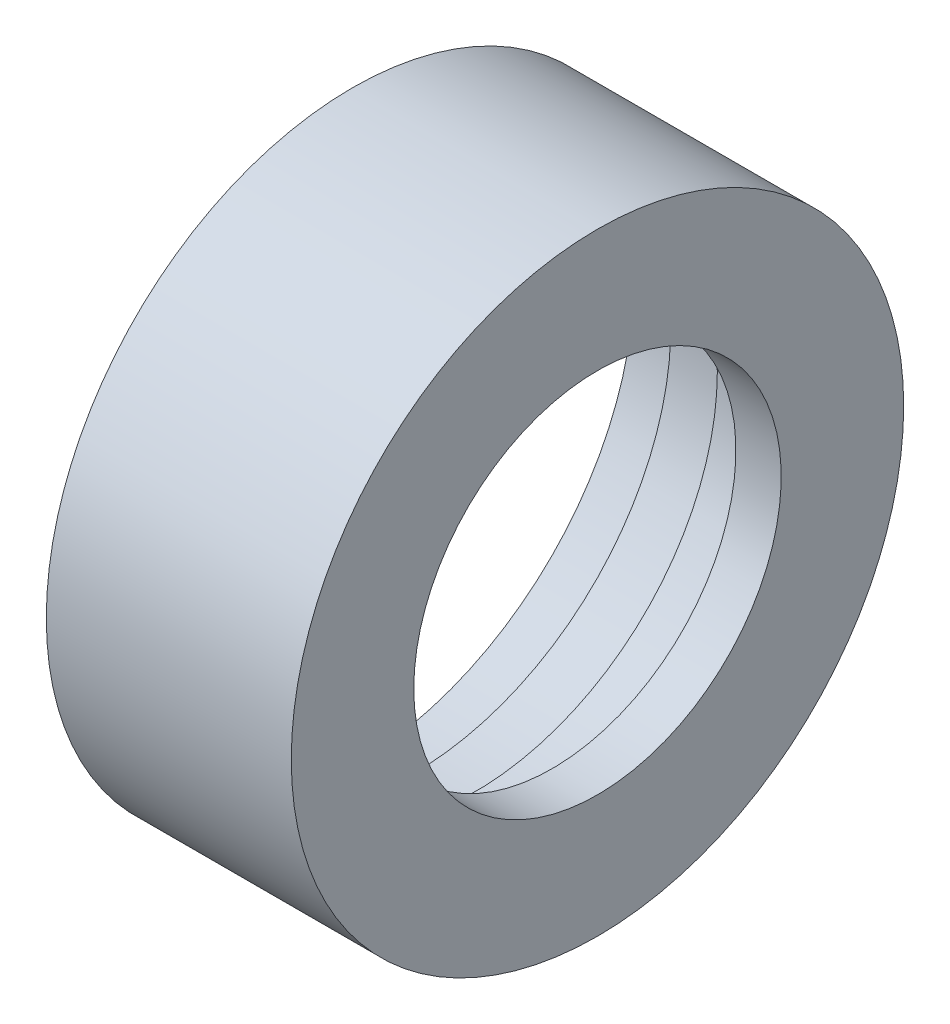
from build123d import *


with BuildPart() as part:
    # Sketch1 → Revolve1 (revolve)
    with BuildSketch(Plane.XY, mode=Mode.PRIVATE) as revolve1_sk:
        Polygon((-269.312731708, 25.125), (-276.296564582, 25.125), (-276.296564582, 26.7), (-282.696564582, 26.7), (-282.696564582, 29.2), (-288.996564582, 29.2), (-288.996564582, 31.75), (-263.596564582, 31.75), (-263.596564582, 19.05), (-268.295849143, 19.05), (-269.291808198, 25), align=None)
    revolve(revolve1_sk.sketch.rotate(Axis((-300.737709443, 0, 0), (1, 0, 0)), 90), axis=Axis((-300.737709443, 0, 0), (1, 0, 0)))


solid = part.part
